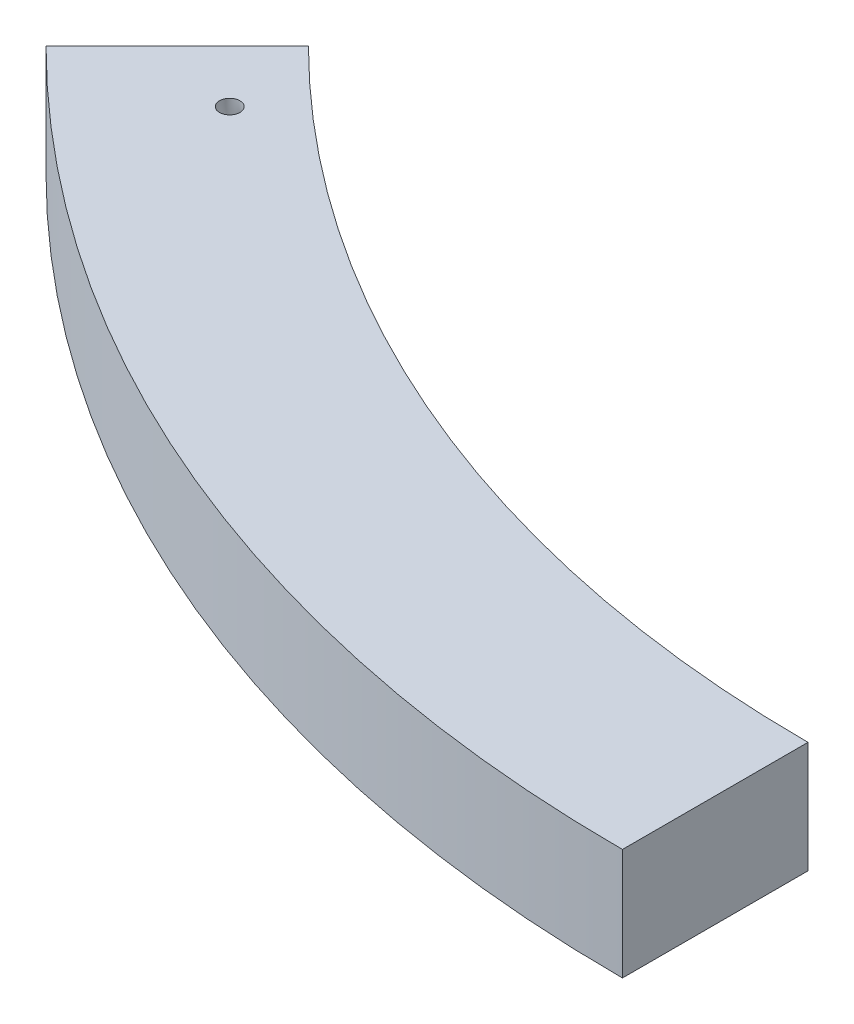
from build123d import *

# Parameters (mm, degrees)
BOSS_EXTRUDE2_DEPTH = 300
SKETCH7_R           = 27.5


with BuildPart() as part:
    # Sketch3 → Boss-Extrude2 (new body)
    with BuildSketch(Plane(origin=(0, 0, 0), x_dir=(1, 0, 0), z_dir=(0, 1, 0))):
        with BuildLine():
            Line((0, -3750), (0, -3250))
            ThreePointArc((0, -3250), (-1243.721155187, -3002.608480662), (-2298.097038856, -2298.097038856))
            Line((-2298.097038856, -2298.097038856), (-2651.65042945, -2651.65042945))
            ThreePointArc((-2651.65042945, -2651.65042945), (-1435.062871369, -3464.548246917), (0, -3750))
        make_face()
    extrude(amount=BOSS_EXTRUDE2_DEPTH)

    # Sketch7 → Cut-Revolve2 (revolve, cut)
    with BuildSketch(Plane(origin=(0, 300, 0), x_dir=(1, 0, 0), z_dir=(0, 1, 0)), mode=Mode.PRIVATE) as cut_revolve2_sk:
        with Locations((-2262.741699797, -2545.584412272)):
            Circle(SKETCH7_R)
    revolve(cut_revolve2_sk.sketch.rotate(Axis((-2298.097038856, 300, 2298.097038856), (0.7071067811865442, 0, 0.7071067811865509)), 46.254403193), axis=Axis((-2298.097038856, 300, 2298.097038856), (0.7071067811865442, 0, 0.7071067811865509)), mode=Mode.SUBTRACT)


solid = part.part
